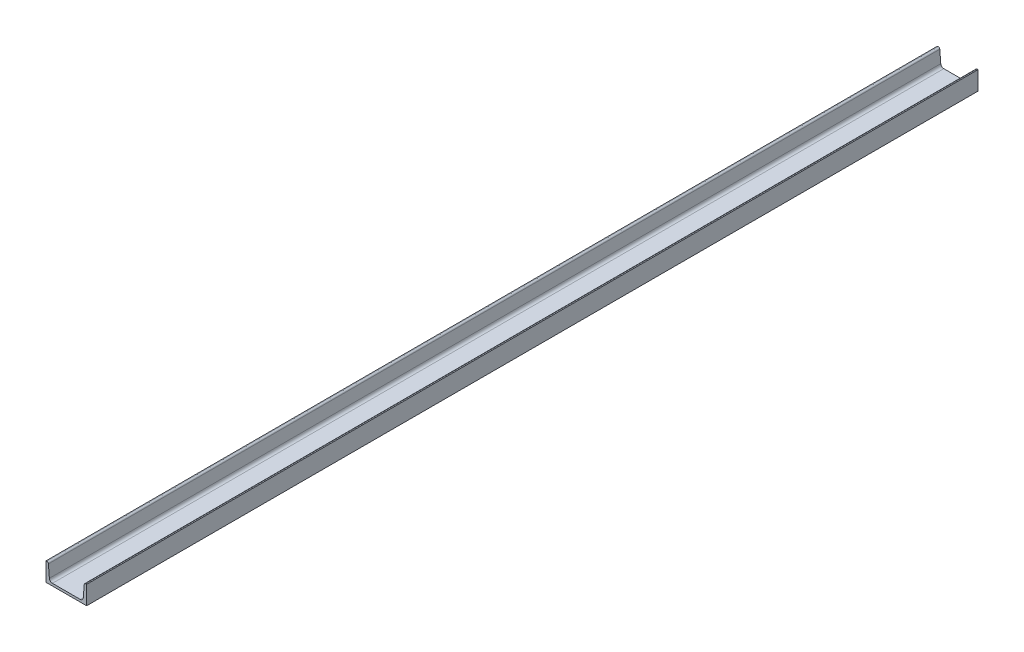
ISO-10303-21;
HEADER;
FILE_DESCRIPTION(('STEP AP214'),'2;1');
FILE_NAME('part.step','',(''),(''),'','','');
FILE_SCHEMA(('AUTOMOTIVE_DESIGN { 1 0 10303 214 1 1 1 1 }'));
ENDSEC;
DATA;
#1=APPLICATION_CONTEXT('core data for automotive mechanical design processes');
#2=APPLICATION_PROTOCOL_DEFINITION('international standard','automotive_design',2000,#1);
#3=PRODUCT_CONTEXT('',#1,'mechanical');
#4=PRODUCT('Part','Part','',(#3));
#5=PRODUCT_RELATED_PRODUCT_CATEGORY('part','',(#4));
#6=PRODUCT_DEFINITION_FORMATION('','',#4);
#7=PRODUCT_DEFINITION_CONTEXT('part definition',#1,'design');
#8=PRODUCT_DEFINITION('design','',#6,#7);
#9=PRODUCT_DEFINITION_SHAPE('','',#8);
#10=(LENGTH_UNIT() NAMED_UNIT(*) SI_UNIT(.MILLI.,.METRE.));
#11=(NAMED_UNIT(*) PLANE_ANGLE_UNIT() SI_UNIT($,.RADIAN.));
#12=(NAMED_UNIT(*) SI_UNIT($,.STERADIAN.) SOLID_ANGLE_UNIT());
#13=UNCERTAINTY_MEASURE_WITH_UNIT(LENGTH_MEASURE(1.E-05),#10,'distance_accuracy_value','');
#14=(GEOMETRIC_REPRESENTATION_CONTEXT(3) GLOBAL_UNCERTAINTY_ASSIGNED_CONTEXT((#13)) GLOBAL_UNIT_ASSIGNED_CONTEXT((#10,
#11,#12)) REPRESENTATION_CONTEXT('',''));
#15=CARTESIAN_POINT('',(0.,0.,0.));
#16=DIRECTION('',(0.,0.,1.));
#17=DIRECTION('',(1.,0.,0.));
#18=AXIS2_PLACEMENT_3D('',#15,#16,#17);
#19=CARTESIAN_POINT('',(41.0512459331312,16.,1316.5));
#20=DIRECTION('',(0.,0.,-1.));
#21=DIRECTION('',(-1.,0.,0.));
#22=AXIS2_PLACEMENT_3D('',#19,#20,#21);
#23=CYLINDRICAL_SURFACE('',#22,9.);
#24=CARTESIAN_POINT('',(41.0512459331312,16.,-1316.5));
#25=DIRECTION('',(0.,0.,1.));
#26=DIRECTION('',(1.,0.,0.));
#27=AXIS2_PLACEMENT_3D('',#24,#25,#26);
#28=CIRCLE('',#27,9.);
#29=CARTESIAN_POINT('',(41.0512459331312,7.,-1316.5));
#30=VERTEX_POINT('',#29);
#31=CARTESIAN_POINT('',(50.0225834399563,15.282292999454,-1316.5));
#32=VERTEX_POINT('',#31);
#33=EDGE_CURVE('E103',#30,#32,#28,.T.);
#34=ORIENTED_EDGE('',*,*,#33,.F.);
#35=DIRECTION('',(0.,0.,-1.));
#36=VECTOR('',#35,1.);
#37=CARTESIAN_POINT('',(41.0512459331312,7.,1316.5));
#38=LINE('',#37,#36);
#39=CARTESIAN_POINT('',(41.0512459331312,7.,1316.5));
#40=VERTEX_POINT('',#39);
#41=EDGE_CURVE('E9',#40,#30,#38,.T.);
#42=ORIENTED_EDGE('',*,*,#41,.F.);
#43=CARTESIAN_POINT('',(41.0512459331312,16.,1316.5));
#44=DIRECTION('',(0.,0.,1.));
#45=DIRECTION('',(1.,0.,0.));
#46=AXIS2_PLACEMENT_3D('',#43,#44,#45);
#47=CIRCLE('',#46,9.);
#48=CARTESIAN_POINT('',(50.0225834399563,15.282292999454,1316.5));
#49=VERTEX_POINT('',#48);
#50=EDGE_CURVE('E105',#40,#49,#47,.T.);
#51=ORIENTED_EDGE('',*,*,#50,.T.);
#52=DIRECTION('',(0.,0.,-1.));
#53=VECTOR('',#52,1.);
#54=CARTESIAN_POINT('',(50.0225834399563,15.282292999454,1316.5));
#55=LINE('',#54,#53);
#56=EDGE_CURVE('E17',#49,#32,#55,.T.);
#57=ORIENTED_EDGE('',*,*,#56,.T.);
#58=EDGE_LOOP('',(#34,#42,#51,#57));
#59=FACE_BOUND('',#58,.T.);
#60=ADVANCED_FACE('F14',(#59),#23,.F.);
#61=CARTESIAN_POINT('',(-41.0512459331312,7.,1316.5));
#62=DIRECTION('',(0.,1.,0.));
#63=DIRECTION('',(0.,0.,1.));
#64=AXIS2_PLACEMENT_3D('',#61,#62,#63);
#65=PLANE('',#64);
#66=DIRECTION('',(1.,0.,0.));
#67=VECTOR('',#66,1.);
#68=CARTESIAN_POINT('',(-41.0512459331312,7.,-1316.5));
#69=LINE('',#68,#67);
#70=CARTESIAN_POINT('',(-41.0512459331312,7.,-1316.5));
#71=VERTEX_POINT('',#70);
#72=EDGE_CURVE('E124',#71,#30,#69,.T.);
#73=ORIENTED_EDGE('',*,*,#72,.F.);
#74=DIRECTION('',(0.,0.,-1.));
#75=VECTOR('',#74,1.);
#76=CARTESIAN_POINT('',(-41.0512459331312,7.,1316.5));
#77=LINE('',#76,#75);
#78=CARTESIAN_POINT('',(-41.0512459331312,7.,1316.5));
#79=VERTEX_POINT('',#78);
#80=EDGE_CURVE('E23',#79,#71,#77,.T.);
#81=ORIENTED_EDGE('',*,*,#80,.F.);
#82=DIRECTION('',(1.,0.,0.));
#83=VECTOR('',#82,1.);
#84=CARTESIAN_POINT('',(-41.0512459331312,7.,1316.5));
#85=LINE('',#84,#83);
#86=EDGE_CURVE('E111',#79,#40,#85,.T.);
#87=ORIENTED_EDGE('',*,*,#86,.T.);
#88=ORIENTED_EDGE('',*,*,#41,.T.);
#89=EDGE_LOOP('',(#73,#81,#87,#88));
#90=FACE_BOUND('',#89,.T.);
#91=ADVANCED_FACE('F315',(#90),#65,.T.);
#92=CARTESIAN_POINT('',(-41.0512459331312,16.,1316.5));
#93=DIRECTION('',(0.,0.,-1.));
#94=DIRECTION('',(-1.,0.,0.));
#95=AXIS2_PLACEMENT_3D('',#92,#93,#94);
#96=CYLINDRICAL_SURFACE('',#95,9.);
#97=CARTESIAN_POINT('',(-41.0512459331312,16.,-1316.5));
#98=DIRECTION('',(0.,0.,1.));
#99=DIRECTION('',(1.,0.,0.));
#100=AXIS2_PLACEMENT_3D('',#97,#98,#99);
#101=CIRCLE('',#100,9.);
#102=CARTESIAN_POINT('',(-50.0225834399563,15.282292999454,-1316.5));
#103=VERTEX_POINT('',#102);
#104=EDGE_CURVE('E337',#103,#71,#101,.T.);
#105=ORIENTED_EDGE('',*,*,#104,.F.);
#106=DIRECTION('',(0.,0.,-1.));
#107=VECTOR('',#106,1.);
#108=CARTESIAN_POINT('',(-50.0225834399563,15.282292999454,1316.5));
#109=LINE('',#108,#107);
#110=CARTESIAN_POINT('',(-50.0225834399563,15.282292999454,1316.5));
#111=VERTEX_POINT('',#110);
#112=EDGE_CURVE('E170',#111,#103,#109,.T.);
#113=ORIENTED_EDGE('',*,*,#112,.F.);
#114=CARTESIAN_POINT('',(-41.0512459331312,16.,1316.5));
#115=DIRECTION('',(0.,0.,1.));
#116=DIRECTION('',(1.,0.,0.));
#117=AXIS2_PLACEMENT_3D('',#114,#115,#116);
#118=CIRCLE('',#117,9.);
#119=EDGE_CURVE('E161',#111,#79,#118,.T.);
#120=ORIENTED_EDGE('',*,*,#119,.T.);
#121=ORIENTED_EDGE('',*,*,#80,.T.);
#122=EDGE_LOOP('',(#105,#113,#120,#121));
#123=FACE_BOUND('',#122,.T.);
#124=ADVANCED_FACE('F306',(#123),#96,.F.);
#125=CARTESIAN_POINT('',(-50.0225834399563,15.282292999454,1316.5));
#126=DIRECTION('',(-0.996815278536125,-0.07974522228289,0.));
#127=DIRECTION('',(0.07974522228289,-0.996815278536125,0.));
#128=AXIS2_PLACEMENT_3D('',#125,#126,#127);
#129=PLANE('',#128);
#130=DIRECTION('',(-0.07974522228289,0.996815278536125,0.));
#131=VECTOR('',#130,1.);
#132=CARTESIAN_POINT('',(-50.0225834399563,15.282292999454,-1316.5));
#133=LINE('',#132,#131);
#134=CARTESIAN_POINT('',(-52.8687082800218,50.858853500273,-1316.5));
#135=VERTEX_POINT('',#134);
#136=EDGE_CURVE('E343',#103,#135,#133,.T.);
#137=ORIENTED_EDGE('',*,*,#136,.T.);
#138=DIRECTION('',(0.,0.,-1.));
#139=VECTOR('',#138,1.);
#140=CARTESIAN_POINT('',(-52.8687082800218,50.858853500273,1316.5));
#141=LINE('',#140,#139);
#142=CARTESIAN_POINT('',(-52.8687082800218,50.858853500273,1316.5));
#143=VERTEX_POINT('',#142);
#144=EDGE_CURVE('E173',#143,#135,#141,.T.);
#145=ORIENTED_EDGE('',*,*,#144,.F.);
#146=DIRECTION('',(-0.07974522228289,0.996815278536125,0.));
#147=VECTOR('',#146,1.);
#148=CARTESIAN_POINT('',(-50.0225834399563,15.282292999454,1316.5));
#149=LINE('',#148,#147);
#150=EDGE_CURVE('E158',#111,#143,#149,.T.);
#151=ORIENTED_EDGE('',*,*,#150,.F.);
#152=ORIENTED_EDGE('',*,*,#112,.T.);
#153=EDGE_LOOP('',(#137,#145,#151,#152));
#154=FACE_BOUND('',#153,.T.);
#155=ADVANCED_FACE('F297',(#154),#129,.F.);
#156=CARTESIAN_POINT('',(-57.3543770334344,50.5,1316.5));
#157=DIRECTION('',(0.,0.,-1.));
#158=DIRECTION('',(-1.,0.,0.));
#159=AXIS2_PLACEMENT_3D('',#156,#157,#158);
#160=CYLINDRICAL_SURFACE('',#159,4.5);
#161=CARTESIAN_POINT('',(-57.3543770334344,50.5,-1316.5));
#162=DIRECTION('',(0.,0.,1.));
#163=DIRECTION('',(1.,0.,0.));
#164=AXIS2_PLACEMENT_3D('',#161,#162,#163);
#165=CIRCLE('',#164,4.5);
#166=CARTESIAN_POINT('',(-57.3543770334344,55.,-1316.5));
#167=VERTEX_POINT('',#166);
#168=EDGE_CURVE('E349',#135,#167,#165,.T.);
#169=ORIENTED_EDGE('',*,*,#168,.T.);
#170=DIRECTION('',(0.,0.,-1.));
#171=VECTOR('',#170,1.);
#172=CARTESIAN_POINT('',(-57.3543770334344,55.,1316.5));
#173=LINE('',#172,#171);
#174=CARTESIAN_POINT('',(-57.3543770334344,55.,1316.5));
#175=VERTEX_POINT('',#174);
#176=EDGE_CURVE('E177',#175,#167,#173,.T.);
#177=ORIENTED_EDGE('',*,*,#176,.F.);
#178=CARTESIAN_POINT('',(-57.3543770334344,50.5,1316.5));
#179=DIRECTION('',(0.,0.,1.));
#180=DIRECTION('',(1.,0.,0.));
#181=AXIS2_PLACEMENT_3D('',#178,#179,#180);
#182=CIRCLE('',#181,4.5);
#183=EDGE_CURVE('E155',#143,#175,#182,.T.);
#184=ORIENTED_EDGE('',*,*,#183,.F.);
#185=ORIENTED_EDGE('',*,*,#144,.T.);
#186=EDGE_LOOP('',(#169,#177,#184,#185));
#187=FACE_BOUND('',#186,.T.);
#188=ADVANCED_FACE('F288',(#187),#160,.T.);
#189=CARTESIAN_POINT('',(-60.,55.,1316.5));
#190=DIRECTION('',(0.,1.,0.));
#191=DIRECTION('',(0.,0.,1.));
#192=AXIS2_PLACEMENT_3D('',#189,#190,#191);
#193=PLANE('',#192);
#194=DIRECTION('',(1.,0.,0.));
#195=VECTOR('',#194,1.);
#196=CARTESIAN_POINT('',(-60.,55.,-1316.5));
#197=LINE('',#196,#195);
#198=CARTESIAN_POINT('',(-60.,55.,-1316.5));
#199=VERTEX_POINT('',#198);
#200=EDGE_CURVE('E357',#199,#167,#197,.T.);
#201=ORIENTED_EDGE('',*,*,#200,.F.);
#202=DIRECTION('',(0.,0.,-1.));
#203=VECTOR('',#202,1.);
#204=CARTESIAN_POINT('',(-60.,55.,1316.5));
#205=LINE('',#204,#203);
#206=CARTESIAN_POINT('',(-60.,55.,1316.5));
#207=VERTEX_POINT('',#206);
#208=EDGE_CURVE('E180',#207,#199,#205,.T.);
#209=ORIENTED_EDGE('',*,*,#208,.F.);
#210=DIRECTION('',(1.,0.,0.));
#211=VECTOR('',#210,1.);
#212=CARTESIAN_POINT('',(-60.,55.,1316.5));
#213=LINE('',#212,#211);
#214=EDGE_CURVE('E151',#207,#175,#213,.T.);
#215=ORIENTED_EDGE('',*,*,#214,.T.);
#216=ORIENTED_EDGE('',*,*,#176,.T.);
#217=EDGE_LOOP('',(#201,#209,#215,#216));
#218=FACE_BOUND('',#217,.T.);
#219=ADVANCED_FACE('F279',(#218),#193,.T.);
#220=CARTESIAN_POINT('',(-60.,55.,1316.5));
#221=DIRECTION('',(1.,0.,0.));
#222=DIRECTION('',(0.,0.,-1.));
#223=AXIS2_PLACEMENT_3D('',#220,#221,#222);
#224=PLANE('',#223);
#225=DIRECTION('',(0.,-1.,0.));
#226=VECTOR('',#225,1.);
#227=CARTESIAN_POINT('',(-60.,55.,-1316.5));
#228=LINE('',#227,#226);
#229=CARTESIAN_POINT('',(-60.,0.,-1316.5));
#230=VERTEX_POINT('',#229);
#231=EDGE_CURVE('E365',#199,#230,#228,.T.);
#232=ORIENTED_EDGE('',*,*,#231,.T.);
#233=DIRECTION('',(0.,0.,-1.));
#234=VECTOR('',#233,1.);
#235=CARTESIAN_POINT('',(-60.,0.,1316.5));
#236=LINE('',#235,#234);
#237=CARTESIAN_POINT('',(-60.,0.,1316.5));
#238=VERTEX_POINT('',#237);
#239=EDGE_CURVE('E183',#238,#230,#236,.T.);
#240=ORIENTED_EDGE('',*,*,#239,.F.);
#241=DIRECTION('',(0.,-1.,0.));
#242=VECTOR('',#241,1.);
#243=CARTESIAN_POINT('',(-60.,55.,1316.5));
#244=LINE('',#243,#242);
#245=EDGE_CURVE('E148',#207,#238,#244,.T.);
#246=ORIENTED_EDGE('',*,*,#245,.F.);
#247=ORIENTED_EDGE('',*,*,#208,.T.);
#248=EDGE_LOOP('',(#232,#240,#246,#247));
#249=FACE_BOUND('',#248,.T.);
#250=ADVANCED_FACE('F270',(#249),#224,.F.);
#251=CARTESIAN_POINT('',(-60.,0.,1316.5));
#252=DIRECTION('',(0.,1.,0.));
#253=DIRECTION('',(0.,0.,1.));
#254=AXIS2_PLACEMENT_3D('',#251,#252,#253);
#255=PLANE('',#254);
#256=DIRECTION('',(1.,0.,0.));
#257=VECTOR('',#256,1.);
#258=CARTESIAN_POINT('',(-60.,0.,-1316.5));
#259=LINE('',#258,#257);
#260=CARTESIAN_POINT('',(60.,0.,-1316.5));
#261=VERTEX_POINT('',#260);
#262=EDGE_CURVE('E372',#230,#261,#259,.T.);
#263=ORIENTED_EDGE('',*,*,#262,.T.);
#264=DIRECTION('',(0.,0.,-1.));
#265=VECTOR('',#264,1.);
#266=CARTESIAN_POINT('',(60.,0.,1316.5));
#267=LINE('',#266,#265);
#268=CARTESIAN_POINT('',(60.,0.,1316.5));
#269=VERTEX_POINT('',#268);
#270=EDGE_CURVE('E187',#269,#261,#267,.T.);
#271=ORIENTED_EDGE('',*,*,#270,.F.);
#272=DIRECTION('',(1.,0.,0.));
#273=VECTOR('',#272,1.);
#274=CARTESIAN_POINT('',(-60.,0.,1316.5));
#275=LINE('',#274,#273);
#276=EDGE_CURVE('E145',#238,#269,#275,.T.);
#277=ORIENTED_EDGE('',*,*,#276,.F.);
#278=ORIENTED_EDGE('',*,*,#239,.T.);
#279=EDGE_LOOP('',(#263,#271,#277,#278));
#280=FACE_BOUND('',#279,.T.);
#281=ADVANCED_FACE('F261',(#280),#255,.F.);
#282=CARTESIAN_POINT('',(60.,0.,1316.5));
#283=DIRECTION('',(-1.,0.,0.));
#284=DIRECTION('',(0.,0.,1.));
#285=AXIS2_PLACEMENT_3D('',#282,#283,#284);
#286=PLANE('',#285);
#287=DIRECTION('',(0.,1.,0.));
#288=VECTOR('',#287,1.);
#289=CARTESIAN_POINT('',(60.,0.,-1316.5));
#290=LINE('',#289,#288);
#291=CARTESIAN_POINT('',(60.,55.,-1316.5));
#292=VERTEX_POINT('',#291);
#293=EDGE_CURVE('E379',#261,#292,#290,.T.);
#294=ORIENTED_EDGE('',*,*,#293,.T.);
#295=DIRECTION('',(0.,0.,-1.));
#296=VECTOR('',#295,1.);
#297=CARTESIAN_POINT('',(60.,55.,1316.5));
#298=LINE('',#297,#296);
#299=CARTESIAN_POINT('',(60.,55.,1316.5));
#300=VERTEX_POINT('',#299);
#301=EDGE_CURVE('E191',#300,#292,#298,.T.);
#302=ORIENTED_EDGE('',*,*,#301,.F.);
#303=DIRECTION('',(0.,1.,0.));
#304=VECTOR('',#303,1.);
#305=CARTESIAN_POINT('',(60.,0.,1316.5));
#306=LINE('',#305,#304);
#307=EDGE_CURVE('E142',#269,#300,#306,.T.);
#308=ORIENTED_EDGE('',*,*,#307,.F.);
#309=ORIENTED_EDGE('',*,*,#270,.T.);
#310=EDGE_LOOP('',(#294,#302,#308,#309));
#311=FACE_BOUND('',#310,.T.);
#312=ADVANCED_FACE('F252',(#311),#286,.F.);
#313=CARTESIAN_POINT('',(60.,55.,1316.5));
#314=DIRECTION('',(0.,-1.,0.));
#315=DIRECTION('',(0.,0.,-1.));
#316=AXIS2_PLACEMENT_3D('',#313,#314,#315);
#317=PLANE('',#316);
#318=DIRECTION('',(-1.,0.,0.));
#319=VECTOR('',#318,1.);
#320=CARTESIAN_POINT('',(60.,55.,-1316.5));
#321=LINE('',#320,#319);
#322=CARTESIAN_POINT('',(57.3543770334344,55.,-1316.5));
#323=VERTEX_POINT('',#322);
#324=EDGE_CURVE('E386',#292,#323,#321,.T.);
#325=ORIENTED_EDGE('',*,*,#324,.T.);
#326=DIRECTION('',(0.,0.,-1.));
#327=VECTOR('',#326,1.);
#328=CARTESIAN_POINT('',(57.3543770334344,55.,1316.5));
#329=LINE('',#328,#327);
#330=CARTESIAN_POINT('',(57.3543770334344,55.,1316.5));
#331=VERTEX_POINT('',#330);
#332=EDGE_CURVE('E195',#331,#323,#329,.T.);
#333=ORIENTED_EDGE('',*,*,#332,.F.);
#334=DIRECTION('',(-1.,0.,0.));
#335=VECTOR('',#334,1.);
#336=CARTESIAN_POINT('',(60.,55.,1316.5));
#337=LINE('',#336,#335);
#338=EDGE_CURVE('E139',#300,#331,#337,.T.);
#339=ORIENTED_EDGE('',*,*,#338,.F.);
#340=ORIENTED_EDGE('',*,*,#301,.T.);
#341=EDGE_LOOP('',(#325,#333,#339,#340));
#342=FACE_BOUND('',#341,.T.);
#343=ADVANCED_FACE('F244',(#342),#317,.F.);
#344=CARTESIAN_POINT('',(57.3543770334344,50.5,1316.5));
#345=DIRECTION('',(0.,0.,-1.));
#346=DIRECTION('',(-1.,0.,0.));
#347=AXIS2_PLACEMENT_3D('',#344,#345,#346);
#348=CYLINDRICAL_SURFACE('',#347,4.5);
#349=CARTESIAN_POINT('',(57.3543770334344,50.5,-1316.5));
#350=DIRECTION('',(0.,0.,1.));
#351=DIRECTION('',(1.,0.,0.));
#352=AXIS2_PLACEMENT_3D('',#349,#350,#351);
#353=CIRCLE('',#352,4.5);
#354=CARTESIAN_POINT('',(52.8687082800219,50.858853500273,-1316.5));
#355=VERTEX_POINT('',#354);
#356=EDGE_CURVE('E120',#323,#355,#353,.T.);
#357=ORIENTED_EDGE('',*,*,#356,.T.);
#358=DIRECTION('',(0.,0.,-1.));
#359=VECTOR('',#358,1.);
#360=CARTESIAN_POINT('',(52.8687082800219,50.858853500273,1316.5));
#361=LINE('',#360,#359);
#362=CARTESIAN_POINT('',(52.8687082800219,50.858853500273,1316.5));
#363=VERTEX_POINT('',#362);
#364=EDGE_CURVE('E110',#363,#355,#361,.T.);
#365=ORIENTED_EDGE('',*,*,#364,.F.);
#366=CARTESIAN_POINT('',(57.3543770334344,50.5,1316.5));
#367=DIRECTION('',(0.,0.,1.));
#368=DIRECTION('',(1.,0.,0.));
#369=AXIS2_PLACEMENT_3D('',#366,#367,#368);
#370=CIRCLE('',#369,4.5);
#371=EDGE_CURVE('E136',#331,#363,#370,.T.);
#372=ORIENTED_EDGE('',*,*,#371,.F.);
#373=ORIENTED_EDGE('',*,*,#332,.T.);
#374=EDGE_LOOP('',(#357,#365,#372,#373));
#375=FACE_BOUND('',#374,.T.);
#376=ADVANCED_FACE('F211',(#375),#348,.T.);
#377=CARTESIAN_POINT('',(50.0225834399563,15.282292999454,1316.5));
#378=DIRECTION('',(-0.996815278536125,0.0797452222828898,0.));
#379=DIRECTION('',(-0.0797452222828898,-0.996815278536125,0.));
#380=AXIS2_PLACEMENT_3D('',#377,#378,#379);
#381=PLANE('',#380);
#382=DIRECTION('',(0.0797452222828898,0.996815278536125,0.));
#383=VECTOR('',#382,1.);
#384=CARTESIAN_POINT('',(50.0225834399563,15.282292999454,-1316.5));
#385=LINE('',#384,#383);
#386=EDGE_CURVE('E113',#32,#355,#385,.T.);
#387=ORIENTED_EDGE('',*,*,#386,.F.);
#388=ORIENTED_EDGE('',*,*,#56,.F.);
#389=DIRECTION('',(0.0797452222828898,0.996815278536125,0.));
#390=VECTOR('',#389,1.);
#391=CARTESIAN_POINT('',(50.0225834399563,15.282292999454,1316.5));
#392=LINE('',#391,#390);
#393=EDGE_CURVE('E133',#49,#363,#392,.T.);
#394=ORIENTED_EDGE('',*,*,#393,.T.);
#395=ORIENTED_EDGE('',*,*,#364,.T.);
#396=EDGE_LOOP('',(#387,#388,#394,#395));
#397=FACE_BOUND('',#396,.T.);
#398=ADVANCED_FACE('F114',(#397),#381,.T.);
#399=CARTESIAN_POINT('',(41.0512459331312,16.,1316.5));
#400=DIRECTION('',(0.,0.,1.));
#401=DIRECTION('',(1.,0.,0.));
#402=AXIS2_PLACEMENT_3D('',#399,#400,#401);
#403=PLANE('',#402);
#404=ORIENTED_EDGE('',*,*,#50,.F.);
#405=ORIENTED_EDGE('',*,*,#86,.F.);
#406=ORIENTED_EDGE('',*,*,#119,.F.);
#407=ORIENTED_EDGE('',*,*,#150,.T.);
#408=ORIENTED_EDGE('',*,*,#183,.T.);
#409=ORIENTED_EDGE('',*,*,#214,.F.);
#410=ORIENTED_EDGE('',*,*,#245,.T.);
#411=ORIENTED_EDGE('',*,*,#276,.T.);
#412=ORIENTED_EDGE('',*,*,#307,.T.);
#413=ORIENTED_EDGE('',*,*,#338,.T.);
#414=ORIENTED_EDGE('',*,*,#371,.T.);
#415=ORIENTED_EDGE('',*,*,#393,.F.);
#416=EDGE_LOOP('',(#404,#405,#406,#407,#408,#409,#410,#411,#412,#413,#414,#415));
#417=FACE_BOUND('',#416,.T.);
#418=ADVANCED_FACE('F210',(#417),#403,.T.);
#419=CARTESIAN_POINT('',(41.0512459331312,16.,-1316.5));
#420=DIRECTION('',(0.,0.,1.));
#421=DIRECTION('',(1.,0.,0.));
#422=AXIS2_PLACEMENT_3D('',#419,#420,#421);
#423=PLANE('',#422);
#424=ORIENTED_EDGE('',*,*,#33,.T.);
#425=ORIENTED_EDGE('',*,*,#386,.T.);
#426=ORIENTED_EDGE('',*,*,#356,.F.);
#427=ORIENTED_EDGE('',*,*,#324,.F.);
#428=ORIENTED_EDGE('',*,*,#293,.F.);
#429=ORIENTED_EDGE('',*,*,#262,.F.);
#430=ORIENTED_EDGE('',*,*,#231,.F.);
#431=ORIENTED_EDGE('',*,*,#200,.T.);
#432=ORIENTED_EDGE('',*,*,#168,.F.);
#433=ORIENTED_EDGE('',*,*,#136,.F.);
#434=ORIENTED_EDGE('',*,*,#104,.T.);
#435=ORIENTED_EDGE('',*,*,#72,.T.);
#436=EDGE_LOOP('',(#424,#425,#426,#427,#428,#429,#430,#431,#432,#433,#434,#435));
#437=FACE_BOUND('',#436,.T.);
#438=ADVANCED_FACE('F122',(#437),#423,.F.);
#439=CLOSED_SHELL('',(#60,#91,#124,#155,#188,#219,#250,#281,#312,#343,#376,#398,#418,#438));
#440=MANIFOLD_SOLID_BREP('B1',#439);
#441=ADVANCED_BREP_SHAPE_REPRESENTATION('',(#18,#440),#14);
#442=SHAPE_DEFINITION_REPRESENTATION(#9,#441);
ENDSEC;
END-ISO-10303-21;
